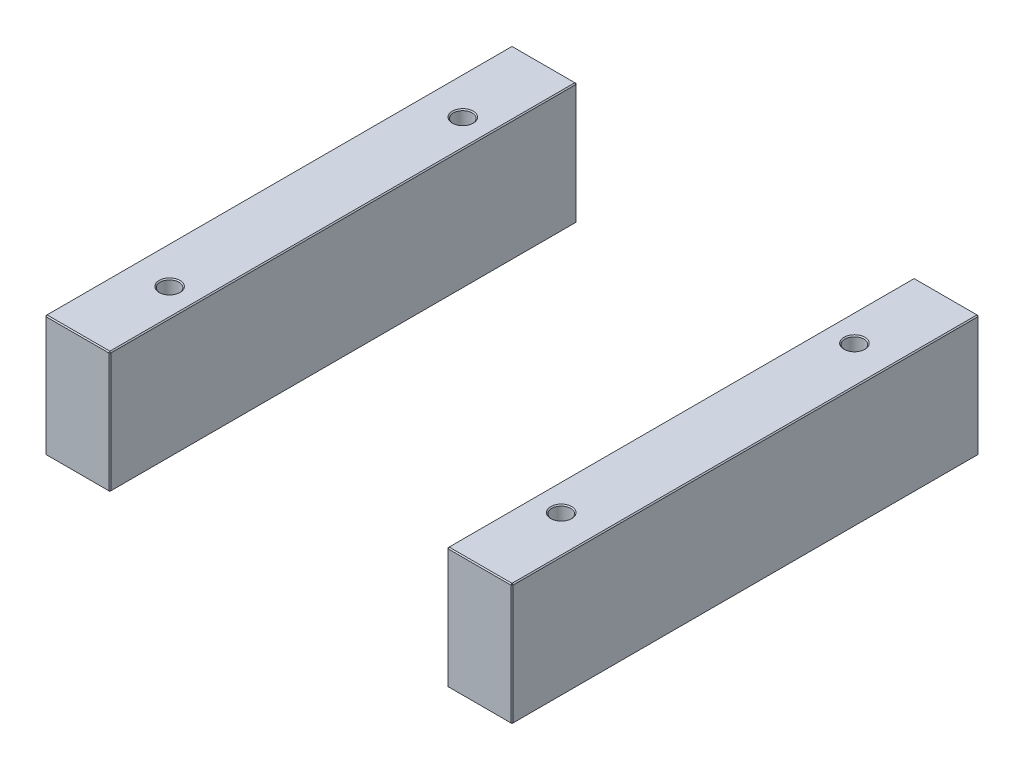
ISO-10303-21;
HEADER;
FILE_DESCRIPTION(('STEP AP214'),'2;1');
FILE_NAME('part.step','',(''),(''),'','','');
FILE_SCHEMA(('AUTOMOTIVE_DESIGN { 1 0 10303 214 1 1 1 1 }'));
ENDSEC;
DATA;
#1=APPLICATION_CONTEXT('core data for automotive mechanical design processes');
#2=APPLICATION_PROTOCOL_DEFINITION('international standard','automotive_design',2000,#1);
#3=PRODUCT_CONTEXT('',#1,'mechanical');
#4=PRODUCT('Part','Part','',(#3));
#5=PRODUCT_RELATED_PRODUCT_CATEGORY('part','',(#4));
#6=PRODUCT_DEFINITION_FORMATION('','',#4);
#7=PRODUCT_DEFINITION_CONTEXT('part definition',#1,'design');
#8=PRODUCT_DEFINITION('design','',#6,#7);
#9=PRODUCT_DEFINITION_SHAPE('','',#8);
#10=(LENGTH_UNIT() NAMED_UNIT(*) SI_UNIT(.MILLI.,.METRE.));
#11=(NAMED_UNIT(*) PLANE_ANGLE_UNIT() SI_UNIT($,.RADIAN.));
#12=(NAMED_UNIT(*) SI_UNIT($,.STERADIAN.) SOLID_ANGLE_UNIT());
#13=UNCERTAINTY_MEASURE_WITH_UNIT(LENGTH_MEASURE(1.E-05),#10,'distance_accuracy_value','');
#14=(GEOMETRIC_REPRESENTATION_CONTEXT(3) GLOBAL_UNCERTAINTY_ASSIGNED_CONTEXT((#13)) GLOBAL_UNIT_ASSIGNED_CONTEXT((#10,
#11,#12)) REPRESENTATION_CONTEXT('',''));
#15=CARTESIAN_POINT('',(0.,0.,0.));
#16=DIRECTION('',(0.,0.,1.));
#17=DIRECTION('',(1.,0.,0.));
#18=AXIS2_PLACEMENT_3D('',#15,#16,#17);
#19=CARTESIAN_POINT('',(-223.,116.,-223.));
#20=DIRECTION('',(0.,0.,1.));
#21=DIRECTION('',(1.,0.,0.));
#22=AXIS2_PLACEMENT_3D('',#19,#20,#21);
#23=PLANE('',#22);
#24=DIRECTION('',(-1.,0.,0.));
#25=VECTOR('',#24,1.);
#26=CARTESIAN_POINT('',(-223.,0.999999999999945,-223.));
#27=LINE('',#26,#25);
#28=CARTESIAN_POINT('',(-162.,0.999999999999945,-223.));
#29=VERTEX_POINT('',#28);
#30=CARTESIAN_POINT('',(-222.,0.999999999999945,-223.));
#31=VERTEX_POINT('',#30);
#32=EDGE_CURVE('P0_E137',#29,#31,#27,.T.);
#33=ORIENTED_EDGE('',*,*,#32,.T.);
#34=DIRECTION('',(0.,1.,0.));
#35=VECTOR('',#34,1.);
#36=CARTESIAN_POINT('',(-222.,116.,-223.));
#37=LINE('',#36,#35);
#38=CARTESIAN_POINT('',(-222.,115.,-223.));
#39=VERTEX_POINT('',#38);
#40=EDGE_CURVE('P0_E235',#31,#39,#37,.T.);
#41=ORIENTED_EDGE('',*,*,#40,.T.);
#42=DIRECTION('',(1.,0.,0.));
#43=VECTOR('',#42,1.);
#44=CARTESIAN_POINT('',(-223.,115.,-223.));
#45=LINE('',#44,#43);
#46=CARTESIAN_POINT('',(-162.,115.,-223.));
#47=VERTEX_POINT('',#46);
#48=EDGE_CURVE('P0_E233',#39,#47,#45,.T.);
#49=ORIENTED_EDGE('',*,*,#48,.T.);
#50=DIRECTION('',(0.,-1.,0.));
#51=VECTOR('',#50,1.);
#52=CARTESIAN_POINT('',(-162.,116.,-223.));
#53=LINE('',#52,#51);
#54=EDGE_CURVE('P0_E230',#47,#29,#53,.T.);
#55=ORIENTED_EDGE('',*,*,#54,.T.);
#56=EDGE_LOOP('',(#33,#41,#49,#55));
#57=FACE_BOUND('',#56,.T.);
#58=ADVANCED_FACE('P0_F16',(#57),#23,.F.);
#59=CARTESIAN_POINT('',(-223.,116.,223.));
#60=DIRECTION('',(1.,0.,0.));
#61=DIRECTION('',(0.,0.,-1.));
#62=AXIS2_PLACEMENT_3D('',#59,#60,#61);
#63=PLANE('',#62);
#64=DIRECTION('',(0.,1.,0.));
#65=VECTOR('',#64,1.);
#66=CARTESIAN_POINT('',(-223.,116.,222.));
#67=LINE('',#66,#65);
#68=CARTESIAN_POINT('',(-223.,0.999999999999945,222.));
#69=VERTEX_POINT('',#68);
#70=CARTESIAN_POINT('',(-223.,115.,222.));
#71=VERTEX_POINT('',#70);
#72=EDGE_CURVE('P0_E217',#69,#71,#67,.T.);
#73=ORIENTED_EDGE('',*,*,#72,.T.);
#74=DIRECTION('',(0.,0.,-1.));
#75=VECTOR('',#74,1.);
#76=CARTESIAN_POINT('',(-223.,115.,223.));
#77=LINE('',#76,#75);
#78=CARTESIAN_POINT('',(-223.,115.,-222.));
#79=VERTEX_POINT('',#78);
#80=EDGE_CURVE('P0_E228',#71,#79,#77,.T.);
#81=ORIENTED_EDGE('',*,*,#80,.T.);
#82=DIRECTION('',(0.,-1.,0.));
#83=VECTOR('',#82,1.);
#84=CARTESIAN_POINT('',(-223.,116.,-222.));
#85=LINE('',#84,#83);
#86=CARTESIAN_POINT('',(-223.,0.999999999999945,-222.));
#87=VERTEX_POINT('',#86);
#88=EDGE_CURVE('P0_E225',#79,#87,#85,.T.);
#89=ORIENTED_EDGE('',*,*,#88,.T.);
#90=DIRECTION('',(0.,0.,1.));
#91=VECTOR('',#90,1.);
#92=CARTESIAN_POINT('',(-223.,0.999999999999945,223.));
#93=LINE('',#92,#91);
#94=EDGE_CURVE('P0_E214',#87,#69,#93,.T.);
#95=ORIENTED_EDGE('',*,*,#94,.T.);
#96=EDGE_LOOP('',(#73,#81,#89,#95));
#97=FACE_BOUND('',#96,.T.);
#98=ADVANCED_FACE('P0_F302',(#97),#63,.F.);
#99=CARTESIAN_POINT('',(-223.,116.,223.));
#100=DIRECTION('',(0.,0.,-1.));
#101=DIRECTION('',(-1.,0.,0.));
#102=AXIS2_PLACEMENT_3D('',#99,#100,#101);
#103=PLANE('',#102);
#104=DIRECTION('',(-1.,0.,0.));
#105=VECTOR('',#104,1.);
#106=CARTESIAN_POINT('',(-223.,115.,223.));
#107=LINE('',#106,#105);
#108=CARTESIAN_POINT('',(-162.,115.,223.));
#109=VERTEX_POINT('',#108);
#110=CARTESIAN_POINT('',(-222.,115.,223.));
#111=VERTEX_POINT('',#110);
#112=EDGE_CURVE('P0_E242',#109,#111,#107,.T.);
#113=ORIENTED_EDGE('',*,*,#112,.T.);
#114=DIRECTION('',(0.,-1.,0.));
#115=VECTOR('',#114,1.);
#116=CARTESIAN_POINT('',(-222.,116.,223.));
#117=LINE('',#116,#115);
#118=CARTESIAN_POINT('',(-222.,0.999999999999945,223.));
#119=VERTEX_POINT('',#118);
#120=EDGE_CURVE('P0_E244',#111,#119,#117,.T.);
#121=ORIENTED_EDGE('',*,*,#120,.T.);
#122=DIRECTION('',(1.,0.,0.));
#123=VECTOR('',#122,1.);
#124=CARTESIAN_POINT('',(-161.,0.999999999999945,223.));
#125=LINE('',#124,#123);
#126=CARTESIAN_POINT('',(-162.,0.999999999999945,223.));
#127=VERTEX_POINT('',#126);
#128=EDGE_CURVE('P0_E240',#119,#127,#125,.T.);
#129=ORIENTED_EDGE('',*,*,#128,.T.);
#130=DIRECTION('',(0.,1.,0.));
#131=VECTOR('',#130,1.);
#132=CARTESIAN_POINT('',(-162.,116.,223.));
#133=LINE('',#132,#131);
#134=EDGE_CURVE('P0_E238',#127,#109,#133,.T.);
#135=ORIENTED_EDGE('',*,*,#134,.T.);
#136=EDGE_LOOP('',(#113,#121,#129,#135));
#137=FACE_BOUND('',#136,.T.);
#138=ADVANCED_FACE('P0_F341',(#137),#103,.F.);
#139=CARTESIAN_POINT('',(-161.,116.,-223.));
#140=DIRECTION('',(-1.,0.,0.));
#141=DIRECTION('',(0.,0.,1.));
#142=AXIS2_PLACEMENT_3D('',#139,#140,#141);
#143=PLANE('',#142);
#144=DIRECTION('',(0.,0.,1.));
#145=VECTOR('',#144,1.);
#146=CARTESIAN_POINT('',(-161.,115.,-223.));
#147=LINE('',#146,#145);
#148=CARTESIAN_POINT('',(-161.,115.,-222.));
#149=VERTEX_POINT('',#148);
#150=CARTESIAN_POINT('',(-161.,115.,222.));
#151=VERTEX_POINT('',#150);
#152=EDGE_CURVE('P0_E31',#149,#151,#147,.T.);
#153=ORIENTED_EDGE('',*,*,#152,.T.);
#154=DIRECTION('',(0.,-1.,0.));
#155=VECTOR('',#154,1.);
#156=CARTESIAN_POINT('',(-161.,116.,222.));
#157=LINE('',#156,#155);
#158=CARTESIAN_POINT('',(-161.,0.999999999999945,222.));
#159=VERTEX_POINT('',#158);
#160=EDGE_CURVE('P0_E190',#151,#159,#157,.T.);
#161=ORIENTED_EDGE('',*,*,#160,.T.);
#162=DIRECTION('',(0.,0.,-1.));
#163=VECTOR('',#162,1.);
#164=CARTESIAN_POINT('',(-161.,0.999999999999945,-223.));
#165=LINE('',#164,#163);
#166=CARTESIAN_POINT('',(-161.,0.999999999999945,-222.));
#167=VERTEX_POINT('',#166);
#168=EDGE_CURVE('P0_E256',#159,#167,#165,.T.);
#169=ORIENTED_EDGE('',*,*,#168,.T.);
#170=DIRECTION('',(0.,1.,0.));
#171=VECTOR('',#170,1.);
#172=CARTESIAN_POINT('',(-161.,116.,-222.));
#173=LINE('',#172,#171);
#174=EDGE_CURVE('P0_E36',#167,#149,#173,.T.);
#175=ORIENTED_EDGE('',*,*,#174,.T.);
#176=EDGE_LOOP('',(#153,#161,#169,#175));
#177=FACE_BOUND('',#176,.T.);
#178=ADVANCED_FACE('P0_F535',(#177),#143,.F.);
#179=CARTESIAN_POINT('',(0.,116.,0.));
#180=DIRECTION('',(0.,-1.,0.));
#181=DIRECTION('',(0.,0.,-1.));
#182=AXIS2_PLACEMENT_3D('',#179,#180,#181);
#183=PLANE('',#182);
#184=CARTESIAN_POINT('',(-187.,116.,140.));
#185=DIRECTION('',(0.,-1.,0.));
#186=DIRECTION('',(0.,0.,-1.));
#187=AXIS2_PLACEMENT_3D('',#184,#185,#186);
#188=CIRCLE('',#187,10.0000000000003);
#189=CARTESIAN_POINT('',(-187.,116.,130.));
#190=VERTEX_POINT('',#189);
#191=EDGE_CURVE('P0_E24',#190,#190,#188,.T.);
#192=ORIENTED_EDGE('',*,*,#191,.T.);
#193=EDGE_LOOP('',(#192));
#194=FACE_BOUND('',#193,.T.);
#195=CARTESIAN_POINT('',(-187.,116.,-140.));
#196=DIRECTION('',(0.,-1.,0.));
#197=DIRECTION('',(0.,0.,-1.));
#198=AXIS2_PLACEMENT_3D('',#195,#196,#197);
#199=CIRCLE('',#198,10.0000000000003);
#200=CARTESIAN_POINT('',(-187.,116.,-150.));
#201=VERTEX_POINT('',#200);
#202=EDGE_CURVE('P0_E189',#201,#201,#199,.T.);
#203=ORIENTED_EDGE('',*,*,#202,.T.);
#204=EDGE_LOOP('',(#203));
#205=FACE_BOUND('',#204,.T.);
#206=DIRECTION('',(0.,0.,1.));
#207=VECTOR('',#206,1.);
#208=CARTESIAN_POINT('',(-222.,116.,0.));
#209=LINE('',#208,#207);
#210=CARTESIAN_POINT('',(-222.,116.,-222.));
#211=VERTEX_POINT('',#210);
#212=CARTESIAN_POINT('',(-222.,116.,222.));
#213=VERTEX_POINT('',#212);
#214=EDGE_CURVE('P0_E251',#211,#213,#209,.T.);
#215=ORIENTED_EDGE('',*,*,#214,.T.);
#216=DIRECTION('',(1.,0.,0.));
#217=VECTOR('',#216,1.);
#218=CARTESIAN_POINT('',(0.,116.,222.));
#219=LINE('',#218,#217);
#220=CARTESIAN_POINT('',(-162.,116.,222.));
#221=VERTEX_POINT('',#220);
#222=EDGE_CURVE('P0_E253',#213,#221,#219,.T.);
#223=ORIENTED_EDGE('',*,*,#222,.T.);
#224=DIRECTION('',(0.,0.,-1.));
#225=VECTOR('',#224,1.);
#226=CARTESIAN_POINT('',(-162.,116.,0.));
#227=LINE('',#226,#225);
#228=CARTESIAN_POINT('',(-162.,116.,-222.));
#229=VERTEX_POINT('',#228);
#230=EDGE_CURVE('P0_E247',#221,#229,#227,.T.);
#231=ORIENTED_EDGE('',*,*,#230,.T.);
#232=DIRECTION('',(-1.,0.,0.));
#233=VECTOR('',#232,1.);
#234=CARTESIAN_POINT('',(0.,116.,-222.));
#235=LINE('',#234,#233);
#236=EDGE_CURVE('P0_E249',#229,#211,#235,.T.);
#237=ORIENTED_EDGE('',*,*,#236,.T.);
#238=EDGE_LOOP('',(#215,#223,#231,#237));
#239=FACE_BOUND('',#238,.T.);
#240=ADVANCED_FACE('P0_F195',(#194,#205,#239),#183,.F.);
#241=CARTESIAN_POINT('',(0.,0.,0.));
#242=DIRECTION('',(0.,-1.,0.));
#243=DIRECTION('',(0.,0.,-1.));
#244=AXIS2_PLACEMENT_3D('',#241,#242,#243);
#245=PLANE('',#244);
#246=CARTESIAN_POINT('',(-187.,0.,-140.));
#247=DIRECTION('',(0.,-1.,0.));
#248=DIRECTION('',(0.,0.,-1.));
#249=AXIS2_PLACEMENT_3D('',#246,#247,#248);
#250=CIRCLE('',#249,9.99999999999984);
#251=CARTESIAN_POINT('',(-187.,0.,-150.));
#252=VERTEX_POINT('',#251);
#253=EDGE_CURVE('P0_E220',#252,#252,#250,.F.);
#254=ORIENTED_EDGE('',*,*,#253,.T.);
#255=EDGE_LOOP('',(#254));
#256=FACE_BOUND('',#255,.T.);
#257=CARTESIAN_POINT('',(-187.,0.,140.));
#258=DIRECTION('',(0.,-1.,0.));
#259=DIRECTION('',(0.,0.,-1.));
#260=AXIS2_PLACEMENT_3D('',#257,#258,#259);
#261=CIRCLE('',#260,9.99999999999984);
#262=CARTESIAN_POINT('',(-187.,0.,130.));
#263=VERTEX_POINT('',#262);
#264=EDGE_CURVE('P0_E608',#263,#263,#261,.F.);
#265=ORIENTED_EDGE('',*,*,#264,.T.);
#266=EDGE_LOOP('',(#265));
#267=FACE_BOUND('',#266,.T.);
#268=DIRECTION('',(-1.,0.,0.));
#269=VECTOR('',#268,1.);
#270=CARTESIAN_POINT('',(-223.,0.,222.));
#271=LINE('',#270,#269);
#272=CARTESIAN_POINT('',(-162.,0.,222.));
#273=VERTEX_POINT('',#272);
#274=CARTESIAN_POINT('',(-222.,0.,222.));
#275=VERTEX_POINT('',#274);
#276=EDGE_CURVE('P0_E114',#273,#275,#271,.T.);
#277=ORIENTED_EDGE('',*,*,#276,.T.);
#278=DIRECTION('',(0.,0.,-1.));
#279=VECTOR('',#278,1.);
#280=CARTESIAN_POINT('',(-222.,0.,-223.));
#281=LINE('',#280,#279);
#282=CARTESIAN_POINT('',(-222.,0.,-222.));
#283=VERTEX_POINT('',#282);
#284=EDGE_CURVE('P0_E110',#275,#283,#281,.T.);
#285=ORIENTED_EDGE('',*,*,#284,.T.);
#286=DIRECTION('',(1.,0.,0.));
#287=VECTOR('',#286,1.);
#288=CARTESIAN_POINT('',(-161.,0.,-222.));
#289=LINE('',#288,#287);
#290=CARTESIAN_POINT('',(-162.,0.,-222.));
#291=VERTEX_POINT('',#290);
#292=EDGE_CURVE('P0_E104',#283,#291,#289,.T.);
#293=ORIENTED_EDGE('',*,*,#292,.T.);
#294=DIRECTION('',(0.,0.,1.));
#295=VECTOR('',#294,1.);
#296=CARTESIAN_POINT('',(-162.,0.,223.));
#297=LINE('',#296,#295);
#298=EDGE_CURVE('P0_E107',#291,#273,#297,.T.);
#299=ORIENTED_EDGE('',*,*,#298,.T.);
#300=EDGE_LOOP('',(#277,#285,#293,#299));
#301=FACE_BOUND('',#300,.T.);
#302=ADVANCED_FACE('P0_F106',(#256,#267,#301),#245,.T.);
#303=CARTESIAN_POINT('',(-187.,0.,-140.));
#304=DIRECTION('',(0.,1.,0.));
#305=DIRECTION('',(0.,0.,1.));
#306=AXIS2_PLACEMENT_3D('',#303,#304,#305);
#307=CYLINDRICAL_SURFACE('',#306,9.);
#308=CARTESIAN_POINT('',(-187.,115.,-140.));
#309=DIRECTION('',(0.,-1.,0.));
#310=DIRECTION('',(0.,0.,-1.));
#311=AXIS2_PLACEMENT_3D('',#308,#309,#310);
#312=CIRCLE('',#311,9.);
#313=CARTESIAN_POINT('',(-187.,115.,-149.));
#314=VERTEX_POINT('',#313);
#315=EDGE_CURVE('P0_E10',#314,#314,#312,.F.);
#316=ORIENTED_EDGE('',*,*,#315,.T.);
#317=EDGE_LOOP('',(#316));
#318=FACE_BOUND('',#317,.T.);
#319=CARTESIAN_POINT('',(-187.,0.99999999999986,-140.));
#320=DIRECTION('',(0.,-1.,0.));
#321=DIRECTION('',(0.,0.,-1.));
#322=AXIS2_PLACEMENT_3D('',#319,#320,#321);
#323=CIRCLE('',#322,9.);
#324=CARTESIAN_POINT('',(-187.,0.99999999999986,-149.));
#325=VERTEX_POINT('',#324);
#326=EDGE_CURVE('P0_E215',#325,#325,#323,.T.);
#327=ORIENTED_EDGE('',*,*,#326,.T.);
#328=EDGE_LOOP('',(#327));
#329=FACE_BOUND('',#328,.T.);
#330=ADVANCED_FACE('P0_F208',(#318,#329),#307,.F.);
#331=CARTESIAN_POINT('',(-187.,0.,140.));
#332=DIRECTION('',(0.,1.,0.));
#333=DIRECTION('',(0.,0.,1.));
#334=AXIS2_PLACEMENT_3D('',#331,#332,#333);
#335=CYLINDRICAL_SURFACE('',#334,9.);
#336=CARTESIAN_POINT('',(-187.,115.,140.));
#337=DIRECTION('',(0.,-1.,0.));
#338=DIRECTION('',(0.,0.,-1.));
#339=AXIS2_PLACEMENT_3D('',#336,#337,#338);
#340=CIRCLE('',#339,9.);
#341=CARTESIAN_POINT('',(-187.,115.,131.));
#342=VERTEX_POINT('',#341);
#343=EDGE_CURVE('P0_E186',#342,#342,#340,.F.);
#344=ORIENTED_EDGE('',*,*,#343,.T.);
#345=EDGE_LOOP('',(#344));
#346=FACE_BOUND('',#345,.T.);
#347=CARTESIAN_POINT('',(-187.,0.99999999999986,140.));
#348=DIRECTION('',(0.,-1.,0.));
#349=DIRECTION('',(0.,0.,-1.));
#350=AXIS2_PLACEMENT_3D('',#347,#348,#349);
#351=CIRCLE('',#350,9.);
#352=CARTESIAN_POINT('',(-187.,0.99999999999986,131.));
#353=VERTEX_POINT('',#352);
#354=EDGE_CURVE('P0_E212',#353,#353,#351,.T.);
#355=ORIENTED_EDGE('',*,*,#354,.T.);
#356=EDGE_LOOP('',(#355));
#357=FACE_BOUND('',#356,.T.);
#358=ADVANCED_FACE('P0_F204',(#346,#357),#335,.F.);
#359=CARTESIAN_POINT('',(-187.,0.,-140.));
#360=DIRECTION('',(0.,-1.,0.));
#361=DIRECTION('',(0.,0.,-1.));
#362=AXIS2_PLACEMENT_3D('',#359,#360,#361);
#363=CONICAL_SURFACE('',#362,9.99999999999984,0.785398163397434);
#364=ORIENTED_EDGE('',*,*,#326,.F.);
#365=EDGE_LOOP('',(#364));
#366=FACE_BOUND('',#365,.T.);
#367=ORIENTED_EDGE('',*,*,#253,.F.);
#368=EDGE_LOOP('',(#367));
#369=FACE_BOUND('',#368,.T.);
#370=ADVANCED_FACE('P0_F207',(#366,#369),#363,.F.);
#371=CARTESIAN_POINT('',(-187.,0.,140.));
#372=DIRECTION('',(0.,-1.,0.));
#373=DIRECTION('',(0.,0.,-1.));
#374=AXIS2_PLACEMENT_3D('',#371,#372,#373);
#375=CONICAL_SURFACE('',#374,9.99999999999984,0.785398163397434);
#376=ORIENTED_EDGE('',*,*,#354,.F.);
#377=EDGE_LOOP('',(#376));
#378=FACE_BOUND('',#377,.T.);
#379=ORIENTED_EDGE('',*,*,#264,.F.);
#380=EDGE_LOOP('',(#379));
#381=FACE_BOUND('',#380,.T.);
#382=ADVANCED_FACE('P0_F347',(#378,#381),#375,.F.);
#383=CARTESIAN_POINT('',(-161.,116.,222.));
#384=DIRECTION('',(-0.707106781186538,0.,-0.707106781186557));
#385=DIRECTION('',(0.,-1.,0.));
#386=AXIS2_PLACEMENT_3D('',#383,#384,#385);
#387=PLANE('',#386);
#388=DIRECTION('',(-0.707106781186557,0.,0.707106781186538));
#389=VECTOR('',#388,1.);
#390=CARTESIAN_POINT('',(-161.5,115.,222.5));
#391=LINE('',#390,#389);
#392=EDGE_CURVE('P0_E125',#109,#151,#391,.F.);
#393=ORIENTED_EDGE('',*,*,#392,.F.);
#394=ORIENTED_EDGE('',*,*,#134,.F.);
#395=DIRECTION('',(0.707106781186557,0.,-0.707106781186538));
#396=VECTOR('',#395,1.);
#397=CARTESIAN_POINT('',(-162.,0.999999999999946,223.));
#398=LINE('',#397,#396);
#399=EDGE_CURVE('P0_E181',#159,#127,#398,.F.);
#400=ORIENTED_EDGE('',*,*,#399,.F.);
#401=ORIENTED_EDGE('',*,*,#160,.F.);
#402=EDGE_LOOP('',(#393,#394,#400,#401));
#403=FACE_BOUND('',#402,.T.);
#404=ADVANCED_FACE('P0_F351',(#403),#387,.F.);
#405=CARTESIAN_POINT('',(-162.,116.,222.));
#406=DIRECTION('',(0.577350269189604,0.57735026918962,0.577350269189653));
#407=DIRECTION('',(0.,-0.707106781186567,0.707106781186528));
#408=AXIS2_PLACEMENT_3D('',#405,#406,#407);
#409=PLANE('',#408);
#410=DIRECTION('',(0.,0.707106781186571,-0.707106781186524));
#411=VECTOR('',#410,1.);
#412=CARTESIAN_POINT('',(-162.,116.,222.));
#413=LINE('',#412,#411);
#414=EDGE_CURVE('P0_E175',#109,#221,#413,.T.);
#415=ORIENTED_EDGE('',*,*,#414,.F.);
#416=ORIENTED_EDGE('',*,*,#392,.T.);
#417=DIRECTION('',(0.707106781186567,-0.707106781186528,0.));
#418=VECTOR('',#417,1.);
#419=CARTESIAN_POINT('',(-162.,116.,222.));
#420=LINE('',#419,#418);
#421=EDGE_CURVE('P0_E178',#221,#151,#420,.T.);
#422=ORIENTED_EDGE('',*,*,#421,.F.);
#423=EDGE_LOOP('',(#415,#416,#422));
#424=FACE_BOUND('',#423,.T.);
#425=ADVANCED_FACE('P0_F487',(#424),#409,.T.);
#426=CARTESIAN_POINT('',(-162.,0.999999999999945,223.));
#427=DIRECTION('',(0.577350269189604,-0.577350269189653,0.57735026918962));
#428=DIRECTION('',(0.,-0.707106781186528,-0.707106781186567));
#429=AXIS2_PLACEMENT_3D('',#426,#427,#428);
#430=PLANE('',#429);
#431=DIRECTION('',(0.707106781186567,0.707106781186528,0.));
#432=VECTOR('',#431,1.);
#433=CARTESIAN_POINT('',(-161.5,0.499999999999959,222.));
#434=LINE('',#433,#432);
#435=EDGE_CURVE('P0_E123',#159,#273,#434,.F.);
#436=ORIENTED_EDGE('',*,*,#435,.F.);
#437=ORIENTED_EDGE('',*,*,#399,.T.);
#438=DIRECTION('',(0.,-0.707106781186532,-0.707106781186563));
#439=VECTOR('',#438,1.);
#440=CARTESIAN_POINT('',(-162.,0.999999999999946,223.));
#441=LINE('',#440,#439);
#442=EDGE_CURVE('P0_E172',#273,#127,#441,.F.);
#443=ORIENTED_EDGE('',*,*,#442,.F.);
#444=EDGE_LOOP('',(#436,#437,#443));
#445=FACE_BOUND('',#444,.T.);
#446=ADVANCED_FACE('P0_F478',(#445),#430,.T.);
#447=CARTESIAN_POINT('',(-162.,116.,0.));
#448=DIRECTION('',(-0.707106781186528,-0.707106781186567,0.));
#449=DIRECTION('',(0.,0.,-1.));
#450=AXIS2_PLACEMENT_3D('',#447,#448,#449);
#451=PLANE('',#450);
#452=ORIENTED_EDGE('',*,*,#421,.T.);
#453=ORIENTED_EDGE('',*,*,#152,.F.);
#454=DIRECTION('',(-0.707106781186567,0.707106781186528,0.));
#455=VECTOR('',#454,1.);
#456=CARTESIAN_POINT('',(-161.5,115.5,-222.));
#457=LINE('',#456,#455);
#458=EDGE_CURVE('P0_E165',#229,#149,#457,.F.);
#459=ORIENTED_EDGE('',*,*,#458,.F.);
#460=ORIENTED_EDGE('',*,*,#230,.F.);
#461=EDGE_LOOP('',(#452,#453,#459,#460));
#462=FACE_BOUND('',#461,.T.);
#463=ADVANCED_FACE('P0_F318',(#462),#451,.F.);
#464=CARTESIAN_POINT('',(0.,116.,222.));
#465=DIRECTION('',(0.,-0.707106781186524,-0.707106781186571));
#466=DIRECTION('',(1.,0.,0.));
#467=AXIS2_PLACEMENT_3D('',#464,#465,#466);
#468=PLANE('',#467);
#469=ORIENTED_EDGE('',*,*,#414,.T.);
#470=ORIENTED_EDGE('',*,*,#222,.F.);
#471=DIRECTION('',(0.,-0.707106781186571,0.707106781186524));
#472=VECTOR('',#471,1.);
#473=CARTESIAN_POINT('',(-222.,115.5,222.5));
#474=LINE('',#473,#472);
#475=EDGE_CURVE('P0_E162',#111,#213,#474,.F.);
#476=ORIENTED_EDGE('',*,*,#475,.F.);
#477=ORIENTED_EDGE('',*,*,#112,.F.);
#478=EDGE_LOOP('',(#469,#470,#476,#477));
#479=FACE_BOUND('',#478,.T.);
#480=ADVANCED_FACE('P0_F313',(#479),#468,.F.);
#481=CARTESIAN_POINT('',(-222.,116.,223.));
#482=DIRECTION('',(0.707106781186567,0.,-0.707106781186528));
#483=DIRECTION('',(0.,-1.,0.));
#484=AXIS2_PLACEMENT_3D('',#481,#482,#483);
#485=PLANE('',#484);
#486=DIRECTION('',(0.707106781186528,0.,0.707106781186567));
#487=VECTOR('',#486,1.);
#488=CARTESIAN_POINT('',(-222.,0.999999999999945,223.));
#489=LINE('',#488,#487);
#490=EDGE_CURVE('P0_E156',#119,#69,#489,.F.);
#491=ORIENTED_EDGE('',*,*,#490,.F.);
#492=ORIENTED_EDGE('',*,*,#120,.F.);
#493=DIRECTION('',(-0.707106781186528,0.,-0.707106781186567));
#494=VECTOR('',#493,1.);
#495=CARTESIAN_POINT('',(-223.,115.,222.));
#496=LINE('',#495,#494);
#497=EDGE_CURVE('P0_E159',#71,#111,#496,.F.);
#498=ORIENTED_EDGE('',*,*,#497,.F.);
#499=ORIENTED_EDGE('',*,*,#72,.F.);
#500=EDGE_LOOP('',(#491,#492,#498,#499));
#501=FACE_BOUND('',#500,.T.);
#502=ADVANCED_FACE('P0_F307',(#501),#485,.F.);
#503=CARTESIAN_POINT('',(-223.,0.999999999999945,223.));
#504=DIRECTION('',(0.,-0.707106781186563,0.707106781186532));
#505=DIRECTION('',(-1.,0.,0.));
#506=AXIS2_PLACEMENT_3D('',#503,#504,#505);
#507=PLANE('',#506);
#508=ORIENTED_EDGE('',*,*,#442,.T.);
#509=ORIENTED_EDGE('',*,*,#128,.F.);
#510=DIRECTION('',(0.,0.707106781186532,0.707106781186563));
#511=VECTOR('',#510,1.);
#512=CARTESIAN_POINT('',(-222.,0.999999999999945,223.));
#513=LINE('',#512,#511);
#514=EDGE_CURVE('P0_E134',#275,#119,#513,.T.);
#515=ORIENTED_EDGE('',*,*,#514,.F.);
#516=ORIENTED_EDGE('',*,*,#276,.F.);
#517=EDGE_LOOP('',(#508,#509,#515,#516));
#518=FACE_BOUND('',#517,.T.);
#519=ADVANCED_FACE('P0_F333',(#518),#507,.T.);
#520=CARTESIAN_POINT('',(-161.,0.999999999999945,-223.));
#521=DIRECTION('',(0.707106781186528,-0.707106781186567,0.));
#522=DIRECTION('',(0.,0.,1.));
#523=AXIS2_PLACEMENT_3D('',#520,#521,#522);
#524=PLANE('',#523);
#525=ORIENTED_EDGE('',*,*,#435,.T.);
#526=ORIENTED_EDGE('',*,*,#298,.F.);
#527=DIRECTION('',(-0.707106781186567,-0.707106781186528,0.));
#528=VECTOR('',#527,1.);
#529=CARTESIAN_POINT('',(-162.,0.,-222.));
#530=LINE('',#529,#528);
#531=EDGE_CURVE('P0_E120',#167,#291,#530,.T.);
#532=ORIENTED_EDGE('',*,*,#531,.F.);
#533=ORIENTED_EDGE('',*,*,#168,.F.);
#534=EDGE_LOOP('',(#525,#526,#532,#533));
#535=FACE_BOUND('',#534,.T.);
#536=ADVANCED_FACE('P0_F119',(#535),#524,.T.);
#537=CARTESIAN_POINT('',(-162.,116.,-223.));
#538=DIRECTION('',(-0.707106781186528,0.,0.707106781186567));
#539=DIRECTION('',(0.,-1.,0.));
#540=AXIS2_PLACEMENT_3D('',#537,#538,#539);
#541=PLANE('',#540);
#542=DIRECTION('',(0.707106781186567,0.,0.707106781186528));
#543=VECTOR('',#542,1.);
#544=CARTESIAN_POINT('',(-162.,115.,-223.));
#545=LINE('',#544,#543);
#546=EDGE_CURVE('P0_E168',#149,#47,#545,.F.);
#547=ORIENTED_EDGE('',*,*,#546,.F.);
#548=ORIENTED_EDGE('',*,*,#174,.F.);
#549=DIRECTION('',(-0.707106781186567,0.,-0.707106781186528));
#550=VECTOR('',#549,1.);
#551=CARTESIAN_POINT('',(-161.5,0.999999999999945,-222.5));
#552=LINE('',#551,#550);
#553=EDGE_CURVE('P0_E133',#29,#167,#552,.F.);
#554=ORIENTED_EDGE('',*,*,#553,.F.);
#555=ORIENTED_EDGE('',*,*,#54,.F.);
#556=EDGE_LOOP('',(#547,#548,#554,#555));
#557=FACE_BOUND('',#556,.T.);
#558=ADVANCED_FACE('P0_F323',(#557),#541,.F.);
#559=CARTESIAN_POINT('',(-162.,115.,-223.));
#560=DIRECTION('',(0.577350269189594,0.577350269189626,-0.577350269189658));
#561=DIRECTION('',(0.,0.707106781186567,0.707106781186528));
#562=AXIS2_PLACEMENT_3D('',#559,#560,#561);
#563=PLANE('',#562);
#564=ORIENTED_EDGE('',*,*,#458,.T.);
#565=ORIENTED_EDGE('',*,*,#546,.T.);
#566=DIRECTION('',(0.,-0.707106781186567,-0.707106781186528));
#567=VECTOR('',#566,1.);
#568=CARTESIAN_POINT('',(-162.,115.,-223.));
#569=LINE('',#568,#567);
#570=EDGE_CURVE('P0_E151',#229,#47,#569,.T.);
#571=ORIENTED_EDGE('',*,*,#570,.F.);
#572=EDGE_LOOP('',(#564,#565,#571));
#573=FACE_BOUND('',#572,.T.);
#574=ADVANCED_FACE('P0_F321',(#573),#563,.T.);
#575=CARTESIAN_POINT('',(-223.,115.,222.));
#576=DIRECTION('',(-0.577350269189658,0.577350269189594,0.577350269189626));
#577=DIRECTION('',(0.707106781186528,0.,0.707106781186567));
#578=AXIS2_PLACEMENT_3D('',#575,#576,#577);
#579=PLANE('',#578);
#580=ORIENTED_EDGE('',*,*,#497,.T.);
#581=ORIENTED_EDGE('',*,*,#475,.T.);
#582=DIRECTION('',(0.707106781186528,0.707106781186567,0.));
#583=VECTOR('',#582,1.);
#584=CARTESIAN_POINT('',(-223.,115.,222.));
#585=LINE('',#584,#583);
#586=EDGE_CURVE('P0_E142',#71,#213,#585,.T.);
#587=ORIENTED_EDGE('',*,*,#586,.F.);
#588=EDGE_LOOP('',(#580,#581,#587));
#589=FACE_BOUND('',#588,.T.);
#590=ADVANCED_FACE('P0_F310',(#589),#579,.T.);
#591=CARTESIAN_POINT('',(-222.,0.999999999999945,223.));
#592=DIRECTION('',(-0.577350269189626,-0.577350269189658,0.577350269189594));
#593=DIRECTION('',(0.707106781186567,-0.707106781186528,0.));
#594=AXIS2_PLACEMENT_3D('',#591,#592,#593);
#595=PLANE('',#594);
#596=ORIENTED_EDGE('',*,*,#514,.T.);
#597=ORIENTED_EDGE('',*,*,#490,.T.);
#598=DIRECTION('',(0.707106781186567,-0.707106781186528,0.));
#599=VECTOR('',#598,1.);
#600=CARTESIAN_POINT('',(-222.5,0.499999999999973,222.));
#601=LINE('',#600,#599);
#602=EDGE_CURVE('P0_E138',#275,#69,#601,.F.);
#603=ORIENTED_EDGE('',*,*,#602,.F.);
#604=EDGE_LOOP('',(#596,#597,#603));
#605=FACE_BOUND('',#604,.T.);
#606=ADVANCED_FACE('P0_F368',(#605),#595,.T.);
#607=CARTESIAN_POINT('',(-162.,0.,-222.));
#608=DIRECTION('',(0.577350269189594,-0.577350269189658,-0.577350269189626));
#609=DIRECTION('',(0.,0.707106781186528,-0.707106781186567));
#610=AXIS2_PLACEMENT_3D('',#607,#608,#609);
#611=PLANE('',#610);
#612=ORIENTED_EDGE('',*,*,#553,.T.);
#613=ORIENTED_EDGE('',*,*,#531,.T.);
#614=DIRECTION('',(0.,0.707106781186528,-0.707106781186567));
#615=VECTOR('',#614,1.);
#616=CARTESIAN_POINT('',(-162.,0.,-222.));
#617=LINE('',#616,#615);
#618=EDGE_CURVE('P0_E130',#29,#291,#617,.F.);
#619=ORIENTED_EDGE('',*,*,#618,.F.);
#620=EDGE_LOOP('',(#612,#613,#619));
#621=FACE_BOUND('',#620,.T.);
#622=ADVANCED_FACE('P0_F129',(#621),#611,.T.);
#623=CARTESIAN_POINT('',(0.,116.,-222.));
#624=DIRECTION('',(0.,-0.707106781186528,0.707106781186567));
#625=DIRECTION('',(-1.,0.,0.));
#626=AXIS2_PLACEMENT_3D('',#623,#624,#625);
#627=PLANE('',#626);
#628=ORIENTED_EDGE('',*,*,#570,.T.);
#629=ORIENTED_EDGE('',*,*,#48,.F.);
#630=DIRECTION('',(0.,0.707106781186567,0.707106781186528));
#631=VECTOR('',#630,1.);
#632=CARTESIAN_POINT('',(-222.,115.,-223.));
#633=LINE('',#632,#631);
#634=EDGE_CURVE('P0_E139',#211,#39,#633,.F.);
#635=ORIENTED_EDGE('',*,*,#634,.F.);
#636=ORIENTED_EDGE('',*,*,#236,.F.);
#637=EDGE_LOOP('',(#628,#629,#635,#636));
#638=FACE_BOUND('',#637,.T.);
#639=ADVANCED_FACE('P0_F286',(#638),#627,.F.);
#640=CARTESIAN_POINT('',(-222.,116.,0.));
#641=DIRECTION('',(0.707106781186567,-0.707106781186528,0.));
#642=DIRECTION('',(0.,0.,1.));
#643=AXIS2_PLACEMENT_3D('',#640,#641,#642);
#644=PLANE('',#643);
#645=ORIENTED_EDGE('',*,*,#586,.T.);
#646=ORIENTED_EDGE('',*,*,#214,.F.);
#647=DIRECTION('',(-0.707106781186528,-0.707106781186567,0.));
#648=VECTOR('',#647,1.);
#649=CARTESIAN_POINT('',(-222.5,115.5,-222.));
#650=LINE('',#649,#648);
#651=EDGE_CURVE('P0_E145',#79,#211,#650,.F.);
#652=ORIENTED_EDGE('',*,*,#651,.F.);
#653=ORIENTED_EDGE('',*,*,#80,.F.);
#654=EDGE_LOOP('',(#645,#646,#652,#653));
#655=FACE_BOUND('',#654,.T.);
#656=ADVANCED_FACE('P0_F280',(#655),#644,.F.);
#657=CARTESIAN_POINT('',(-223.,0.999999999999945,223.));
#658=DIRECTION('',(-0.707106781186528,-0.707106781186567,0.));
#659=DIRECTION('',(0.,0.,-1.));
#660=AXIS2_PLACEMENT_3D('',#657,#658,#659);
#661=PLANE('',#660);
#662=ORIENTED_EDGE('',*,*,#602,.T.);
#663=ORIENTED_EDGE('',*,*,#94,.F.);
#664=DIRECTION('',(-0.707106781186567,0.707106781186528,0.));
#665=VECTOR('',#664,1.);
#666=CARTESIAN_POINT('',(-223.,0.999999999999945,-222.));
#667=LINE('',#666,#665);
#668=EDGE_CURVE('P0_E267',#283,#87,#667,.T.);
#669=ORIENTED_EDGE('',*,*,#668,.F.);
#670=ORIENTED_EDGE('',*,*,#284,.F.);
#671=EDGE_LOOP('',(#662,#663,#669,#670));
#672=FACE_BOUND('',#671,.T.);
#673=ADVANCED_FACE('P0_F298',(#672),#661,.T.);
#674=CARTESIAN_POINT('',(-223.,0.999999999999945,-223.));
#675=DIRECTION('',(0.,-0.707106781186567,-0.707106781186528));
#676=DIRECTION('',(1.,0.,0.));
#677=AXIS2_PLACEMENT_3D('',#674,#675,#676);
#678=PLANE('',#677);
#679=ORIENTED_EDGE('',*,*,#618,.T.);
#680=ORIENTED_EDGE('',*,*,#292,.F.);
#681=DIRECTION('',(0.,-0.707106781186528,0.707106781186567));
#682=VECTOR('',#681,1.);
#683=CARTESIAN_POINT('',(-222.,0.499999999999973,-222.5));
#684=LINE('',#683,#682);
#685=EDGE_CURVE('P0_E265',#31,#283,#684,.T.);
#686=ORIENTED_EDGE('',*,*,#685,.F.);
#687=ORIENTED_EDGE('',*,*,#32,.F.);
#688=EDGE_LOOP('',(#679,#680,#686,#687));
#689=FACE_BOUND('',#688,.T.);
#690=ADVANCED_FACE('P0_F136',(#689),#678,.T.);
#691=CARTESIAN_POINT('',(-222.,115.,-223.));
#692=DIRECTION('',(-0.577350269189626,0.577350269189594,-0.577350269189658));
#693=DIRECTION('',(-0.707106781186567,0.,0.707106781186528));
#694=AXIS2_PLACEMENT_3D('',#691,#692,#693);
#695=PLANE('',#694);
#696=ORIENTED_EDGE('',*,*,#651,.T.);
#697=ORIENTED_EDGE('',*,*,#634,.T.);
#698=DIRECTION('',(0.707106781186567,0.,-0.707106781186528));
#699=VECTOR('',#698,1.);
#700=CARTESIAN_POINT('',(-222.,115.,-223.));
#701=LINE('',#700,#699);
#702=EDGE_CURVE('P0_E263',#79,#39,#701,.T.);
#703=ORIENTED_EDGE('',*,*,#702,.F.);
#704=EDGE_LOOP('',(#696,#697,#703));
#705=FACE_BOUND('',#704,.T.);
#706=ADVANCED_FACE('P0_F273',(#705),#695,.T.);
#707=CARTESIAN_POINT('',(-223.,0.999999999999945,-222.));
#708=DIRECTION('',(-0.577350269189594,-0.577350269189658,-0.577350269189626));
#709=DIRECTION('',(0.,0.707106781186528,-0.707106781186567));
#710=AXIS2_PLACEMENT_3D('',#707,#708,#709);
#711=PLANE('',#710);
#712=ORIENTED_EDGE('',*,*,#685,.T.);
#713=ORIENTED_EDGE('',*,*,#668,.T.);
#714=DIRECTION('',(-0.707106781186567,0.,0.707106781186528));
#715=VECTOR('',#714,1.);
#716=CARTESIAN_POINT('',(-223.,0.999999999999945,-222.));
#717=LINE('',#716,#715);
#718=EDGE_CURVE('P0_E261',#31,#87,#717,.T.);
#719=ORIENTED_EDGE('',*,*,#718,.F.);
#720=EDGE_LOOP('',(#712,#713,#719));
#721=FACE_BOUND('',#720,.T.);
#722=ADVANCED_FACE('P0_F294',(#721),#711,.T.);
#723=CARTESIAN_POINT('',(-223.,116.,-222.));
#724=DIRECTION('',(0.707106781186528,0.,0.707106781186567));
#725=DIRECTION('',(0.,-1.,0.));
#726=AXIS2_PLACEMENT_3D('',#723,#724,#725);
#727=PLANE('',#726);
#728=ORIENTED_EDGE('',*,*,#702,.T.);
#729=ORIENTED_EDGE('',*,*,#40,.F.);
#730=ORIENTED_EDGE('',*,*,#718,.T.);
#731=ORIENTED_EDGE('',*,*,#88,.F.);
#732=EDGE_LOOP('',(#728,#729,#730,#731));
#733=FACE_BOUND('',#732,.T.);
#734=ADVANCED_FACE('P0_F201',(#733),#727,.F.);
#735=CARTESIAN_POINT('',(-187.,115.,140.));
#736=DIRECTION('',(0.,1.,0.));
#737=DIRECTION('',(0.,0.,1.));
#738=AXIS2_PLACEMENT_3D('',#735,#736,#737);
#739=CONICAL_SURFACE('',#738,9.,0.785398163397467);
#740=ORIENTED_EDGE('',*,*,#191,.F.);
#741=EDGE_LOOP('',(#740));
#742=FACE_BOUND('',#741,.T.);
#743=ORIENTED_EDGE('',*,*,#343,.F.);
#744=EDGE_LOOP('',(#743));
#745=FACE_BOUND('',#744,.T.);
#746=ADVANCED_FACE('P0_F198',(#742,#745),#739,.F.);
#747=CARTESIAN_POINT('',(-187.,115.,-140.));
#748=DIRECTION('',(0.,1.,0.));
#749=DIRECTION('',(0.,0.,1.));
#750=AXIS2_PLACEMENT_3D('',#747,#748,#749);
#751=CONICAL_SURFACE('',#750,9.,0.785398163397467);
#752=ORIENTED_EDGE('',*,*,#202,.F.);
#753=EDGE_LOOP('',(#752));
#754=FACE_BOUND('',#753,.T.);
#755=ORIENTED_EDGE('',*,*,#315,.F.);
#756=EDGE_LOOP('',(#755));
#757=FACE_BOUND('',#756,.T.);
#758=ADVANCED_FACE('P0_F18',(#754,#757),#751,.F.);
#759=CLOSED_SHELL('',(#58,#98,#138,#178,#240,#302,#330,#358,#370,#382,#404,#425,#446,#463,#480,
#502,#519,#536,#558,#574,#590,#606,#622,#639,#656,#673,#690,#706,#722,#734,#746,#758));
#760=MANIFOLD_SOLID_BREP('P0_B1',#759);
#761=CARTESIAN_POINT('',(223.,116.,223.));
#762=DIRECTION('',(0.,0.,-1.));
#763=DIRECTION('',(-1.,0.,0.));
#764=AXIS2_PLACEMENT_3D('',#761,#762,#763);
#765=PLANE('',#764);
#766=DIRECTION('',(0.,-1.,0.));
#767=VECTOR('',#766,1.);
#768=CARTESIAN_POINT('',(162.,116.,223.));
#769=LINE('',#768,#767);
#770=CARTESIAN_POINT('',(162.,115.,223.));
#771=VERTEX_POINT('',#770);
#772=CARTESIAN_POINT('',(162.,0.99999999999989,223.));
#773=VERTEX_POINT('',#772);
#774=EDGE_CURVE('P1_E174',#771,#773,#769,.T.);
#775=ORIENTED_EDGE('',*,*,#774,.T.);
#776=DIRECTION('',(1.,0.,0.));
#777=VECTOR('',#776,1.);
#778=CARTESIAN_POINT('',(223.,0.99999999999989,223.));
#779=LINE('',#778,#777);
#780=CARTESIAN_POINT('',(222.,0.99999999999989,223.));
#781=VERTEX_POINT('',#780);
#782=EDGE_CURVE('P1_E176',#773,#781,#779,.T.);
#783=ORIENTED_EDGE('',*,*,#782,.T.);
#784=DIRECTION('',(0.,1.,0.));
#785=VECTOR('',#784,1.);
#786=CARTESIAN_POINT('',(222.,116.,223.));
#787=LINE('',#786,#785);
#788=CARTESIAN_POINT('',(222.,115.,223.));
#789=VERTEX_POINT('',#788);
#790=EDGE_CURVE('P1_E172',#781,#789,#787,.T.);
#791=ORIENTED_EDGE('',*,*,#790,.T.);
#792=DIRECTION('',(-1.,0.,0.));
#793=VECTOR('',#792,1.);
#794=CARTESIAN_POINT('',(161.,115.,223.));
#795=LINE('',#794,#793);
#796=EDGE_CURVE('P1_E170',#789,#771,#795,.T.);
#797=ORIENTED_EDGE('',*,*,#796,.T.);
#798=EDGE_LOOP('',(#775,#783,#791,#797));
#799=FACE_BOUND('',#798,.T.);
#800=ADVANCED_FACE('P1_F17',(#799),#765,.F.);
#801=CARTESIAN_POINT('',(223.,116.,223.));
#802=DIRECTION('',(-1.,0.,0.));
#803=DIRECTION('',(0.,0.,1.));
#804=AXIS2_PLACEMENT_3D('',#801,#802,#803);
#805=PLANE('',#804);
#806=DIRECTION('',(0.,0.,1.));
#807=VECTOR('',#806,1.);
#808=CARTESIAN_POINT('',(223.,115.,223.));
#809=LINE('',#808,#807);
#810=CARTESIAN_POINT('',(223.,115.,-222.));
#811=VERTEX_POINT('',#810);
#812=CARTESIAN_POINT('',(223.,115.,222.));
#813=VERTEX_POINT('',#812);
#814=EDGE_CURVE('P1_E188',#811,#813,#809,.T.);
#815=ORIENTED_EDGE('',*,*,#814,.T.);
#816=DIRECTION('',(0.,-1.,0.));
#817=VECTOR('',#816,1.);
#818=CARTESIAN_POINT('',(223.,116.,222.));
#819=LINE('',#818,#817);
#820=CARTESIAN_POINT('',(223.,0.999999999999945,222.));
#821=VERTEX_POINT('',#820);
#822=EDGE_CURVE('P1_E194',#813,#821,#819,.T.);
#823=ORIENTED_EDGE('',*,*,#822,.T.);
#824=DIRECTION('',(0.,0.,-1.));
#825=VECTOR('',#824,1.);
#826=CARTESIAN_POINT('',(223.,0.999999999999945,223.));
#827=LINE('',#826,#825);
#828=CARTESIAN_POINT('',(223.,0.999999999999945,-222.));
#829=VERTEX_POINT('',#828);
#830=EDGE_CURVE('P1_E192',#821,#829,#827,.T.);
#831=ORIENTED_EDGE('',*,*,#830,.T.);
#832=DIRECTION('',(0.,1.,0.));
#833=VECTOR('',#832,1.);
#834=CARTESIAN_POINT('',(223.,116.,-222.));
#835=LINE('',#834,#833);
#836=EDGE_CURVE('P1_E190',#829,#811,#835,.T.);
#837=ORIENTED_EDGE('',*,*,#836,.T.);
#838=EDGE_LOOP('',(#815,#823,#831,#837));
#839=FACE_BOUND('',#838,.T.);
#840=ADVANCED_FACE('P1_F276',(#839),#805,.F.);
#841=CARTESIAN_POINT('',(223.,116.,-223.));
#842=DIRECTION('',(0.,0.,1.));
#843=DIRECTION('',(1.,0.,0.));
#844=AXIS2_PLACEMENT_3D('',#841,#842,#843);
#845=PLANE('',#844);
#846=DIRECTION('',(0.,-1.,0.));
#847=VECTOR('',#846,1.);
#848=CARTESIAN_POINT('',(222.,116.,-223.));
#849=LINE('',#848,#847);
#850=CARTESIAN_POINT('',(222.,115.,-223.));
#851=VERTEX_POINT('',#850);
#852=CARTESIAN_POINT('',(222.,0.999999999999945,-223.));
#853=VERTEX_POINT('',#852);
#854=EDGE_CURVE('P1_E165',#851,#853,#849,.T.);
#855=ORIENTED_EDGE('',*,*,#854,.T.);
#856=DIRECTION('',(-1.,0.,0.));
#857=VECTOR('',#856,1.);
#858=CARTESIAN_POINT('',(223.,0.999999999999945,-223.));
#859=LINE('',#858,#857);
#860=CARTESIAN_POINT('',(162.,0.999999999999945,-223.));
#861=VERTEX_POINT('',#860);
#862=EDGE_CURVE('P1_E113',#853,#861,#859,.T.);
#863=ORIENTED_EDGE('',*,*,#862,.T.);
#864=DIRECTION('',(0.,1.,0.));
#865=VECTOR('',#864,1.);
#866=CARTESIAN_POINT('',(162.,116.,-223.));
#867=LINE('',#866,#865);
#868=CARTESIAN_POINT('',(162.,115.,-223.));
#869=VERTEX_POINT('',#868);
#870=EDGE_CURVE('P1_E167',#861,#869,#867,.T.);
#871=ORIENTED_EDGE('',*,*,#870,.T.);
#872=DIRECTION('',(1.,0.,0.));
#873=VECTOR('',#872,1.);
#874=CARTESIAN_POINT('',(223.,115.,-223.));
#875=LINE('',#874,#873);
#876=EDGE_CURVE('P1_E163',#869,#851,#875,.T.);
#877=ORIENTED_EDGE('',*,*,#876,.T.);
#878=EDGE_LOOP('',(#855,#863,#871,#877));
#879=FACE_BOUND('',#878,.T.);
#880=ADVANCED_FACE('P1_F333',(#879),#845,.F.);
#881=CARTESIAN_POINT('',(161.,116.,-223.));
#882=DIRECTION('',(1.,0.,0.));
#883=DIRECTION('',(0.,0.,-1.));
#884=AXIS2_PLACEMENT_3D('',#881,#882,#883);
#885=PLANE('',#884);
#886=DIRECTION('',(0.,0.,-1.));
#887=VECTOR('',#886,1.);
#888=CARTESIAN_POINT('',(161.,115.,-223.));
#889=LINE('',#888,#887);
#890=CARTESIAN_POINT('',(161.,115.,222.));
#891=VERTEX_POINT('',#890);
#892=CARTESIAN_POINT('',(161.,115.,-222.));
#893=VERTEX_POINT('',#892);
#894=EDGE_CURVE('P1_E179',#891,#893,#889,.T.);
#895=ORIENTED_EDGE('',*,*,#894,.T.);
#896=DIRECTION('',(0.,-1.,0.));
#897=VECTOR('',#896,1.);
#898=CARTESIAN_POINT('',(161.,116.,-222.));
#899=LINE('',#898,#897);
#900=CARTESIAN_POINT('',(161.,0.999999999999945,-222.));
#901=VERTEX_POINT('',#900);
#902=EDGE_CURVE('P1_E185',#893,#901,#899,.T.);
#903=ORIENTED_EDGE('',*,*,#902,.T.);
#904=DIRECTION('',(0.,0.,1.));
#905=VECTOR('',#904,1.);
#906=CARTESIAN_POINT('',(161.,0.999999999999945,-223.));
#907=LINE('',#906,#905);
#908=CARTESIAN_POINT('',(161.,0.999999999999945,222.));
#909=VERTEX_POINT('',#908);
#910=EDGE_CURVE('P1_E183',#901,#909,#907,.T.);
#911=ORIENTED_EDGE('',*,*,#910,.T.);
#912=DIRECTION('',(0.,1.,0.));
#913=VECTOR('',#912,1.);
#914=CARTESIAN_POINT('',(161.,116.,222.));
#915=LINE('',#914,#913);
#916=EDGE_CURVE('P1_E181',#909,#891,#915,.T.);
#917=ORIENTED_EDGE('',*,*,#916,.T.);
#918=EDGE_LOOP('',(#895,#903,#911,#917));
#919=FACE_BOUND('',#918,.T.);
#920=ADVANCED_FACE('P1_F544',(#919),#885,.F.);
#921=CARTESIAN_POINT('',(0.,116.,0.));
#922=DIRECTION('',(0.,1.,0.));
#923=DIRECTION('',(0.,0.,1.));
#924=AXIS2_PLACEMENT_3D('',#921,#922,#923);
#925=PLANE('',#924);
#926=DIRECTION('',(-1.,0.,0.));
#927=VECTOR('',#926,1.);
#928=CARTESIAN_POINT('',(161.,116.,-222.));
#929=LINE('',#928,#927);
#930=CARTESIAN_POINT('',(222.,116.,-222.));
#931=VERTEX_POINT('',#930);
#932=CARTESIAN_POINT('',(162.,116.,-222.));
#933=VERTEX_POINT('',#932);
#934=EDGE_CURVE('P1_E26',#931,#933,#929,.T.);
#935=ORIENTED_EDGE('',*,*,#934,.T.);
#936=DIRECTION('',(0.,0.,1.));
#937=VECTOR('',#936,1.);
#938=CARTESIAN_POINT('',(162.,116.,223.));
#939=LINE('',#938,#937);
#940=CARTESIAN_POINT('',(162.,116.,222.));
#941=VERTEX_POINT('',#940);
#942=EDGE_CURVE('P1_E11',#933,#941,#939,.T.);
#943=ORIENTED_EDGE('',*,*,#942,.T.);
#944=DIRECTION('',(1.,0.,0.));
#945=VECTOR('',#944,1.);
#946=CARTESIAN_POINT('',(223.,116.,222.));
#947=LINE('',#946,#945);
#948=CARTESIAN_POINT('',(222.,116.,222.));
#949=VERTEX_POINT('',#948);
#950=EDGE_CURVE('P1_E203',#941,#949,#947,.T.);
#951=ORIENTED_EDGE('',*,*,#950,.T.);
#952=DIRECTION('',(0.,0.,-1.));
#953=VECTOR('',#952,1.);
#954=CARTESIAN_POINT('',(222.,116.,-223.));
#955=LINE('',#954,#953);
#956=EDGE_CURVE('P1_E37',#949,#931,#955,.T.);
#957=ORIENTED_EDGE('',*,*,#956,.T.);
#958=EDGE_LOOP('',(#935,#943,#951,#957));
#959=FACE_BOUND('',#958,.T.);
#960=CARTESIAN_POINT('',(187.,116.,-140.));
#961=DIRECTION('',(0.,1.,0.));
#962=DIRECTION('',(0.,0.,1.));
#963=AXIS2_PLACEMENT_3D('',#960,#961,#962);
#964=CIRCLE('',#963,10.0000000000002);
#965=CARTESIAN_POINT('',(187.,116.,-130.));
#966=VERTEX_POINT('',#965);
#967=EDGE_CURVE('P1_E200',#966,#966,#964,.F.);
#968=ORIENTED_EDGE('',*,*,#967,.T.);
#969=EDGE_LOOP('',(#968));
#970=FACE_BOUND('',#969,.T.);
#971=CARTESIAN_POINT('',(187.,116.,140.));
#972=DIRECTION('',(0.,1.,0.));
#973=DIRECTION('',(0.,0.,1.));
#974=AXIS2_PLACEMENT_3D('',#971,#972,#973);
#975=CIRCLE('',#974,10.0000000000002);
#976=CARTESIAN_POINT('',(187.,116.,150.));
#977=VERTEX_POINT('',#976);
#978=EDGE_CURVE('P1_E197',#977,#977,#975,.F.);
#979=ORIENTED_EDGE('',*,*,#978,.T.);
#980=EDGE_LOOP('',(#979));
#981=FACE_BOUND('',#980,.T.);
#982=ADVANCED_FACE('P1_F299',(#959,#970,#981),#925,.T.);
#983=CARTESIAN_POINT('',(0.,0.,0.));
#984=DIRECTION('',(0.,1.,0.));
#985=DIRECTION('',(0.,0.,1.));
#986=AXIS2_PLACEMENT_3D('',#983,#984,#985);
#987=PLANE('',#986);
#988=CARTESIAN_POINT('',(187.,0.,-140.));
#989=DIRECTION('',(0.,1.,0.));
#990=DIRECTION('',(0.,0.,1.));
#991=AXIS2_PLACEMENT_3D('',#988,#989,#990);
#992=CIRCLE('',#991,9.99999999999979);
#993=CARTESIAN_POINT('',(187.,0.,-130.));
#994=VERTEX_POINT('',#993);
#995=EDGE_CURVE('P1_E148',#994,#994,#992,.T.);
#996=ORIENTED_EDGE('',*,*,#995,.T.);
#997=EDGE_LOOP('',(#996));
#998=FACE_BOUND('',#997,.T.);
#999=CARTESIAN_POINT('',(187.,0.,140.));
#1000=DIRECTION('',(0.,1.,0.));
#1001=DIRECTION('',(0.,0.,1.));
#1002=AXIS2_PLACEMENT_3D('',#999,#1000,#1001);
#1003=CIRCLE('',#1002,9.99999999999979);
#1004=CARTESIAN_POINT('',(187.,0.,150.));
#1005=VERTEX_POINT('',#1004);
#1006=EDGE_CURVE('P1_E142',#1005,#1005,#1003,.T.);
#1007=ORIENTED_EDGE('',*,*,#1006,.T.);
#1008=EDGE_LOOP('',(#1007));
#1009=FACE_BOUND('',#1008,.T.);
#1010=DIRECTION('',(-1.,0.,0.));
#1011=VECTOR('',#1010,1.);
#1012=CARTESIAN_POINT('',(1.98765735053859E-13,0.,222.));
#1013=LINE('',#1012,#1011);
#1014=CARTESIAN_POINT('',(222.,0.,222.));
#1015=VERTEX_POINT('',#1014);
#1016=CARTESIAN_POINT('',(162.,0.,222.));
#1017=VERTEX_POINT('',#1016);
#1018=EDGE_CURVE('P1_E135',#1015,#1017,#1013,.T.);
#1019=ORIENTED_EDGE('',*,*,#1018,.T.);
#1020=DIRECTION('',(0.,0.,-1.));
#1021=VECTOR('',#1020,1.);
#1022=CARTESIAN_POINT('',(162.,0.,0.));
#1023=LINE('',#1022,#1021);
#1024=CARTESIAN_POINT('',(162.,0.,-222.));
#1025=VERTEX_POINT('',#1024);
#1026=EDGE_CURVE('P1_E139',#1017,#1025,#1023,.T.);
#1027=ORIENTED_EDGE('',*,*,#1026,.T.);
#1028=DIRECTION('',(1.,0.,0.));
#1029=VECTOR('',#1028,1.);
#1030=CARTESIAN_POINT('',(-5.96297205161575E-13,0.,-222.));
#1031=LINE('',#1030,#1029);
#1032=CARTESIAN_POINT('',(222.,0.,-222.));
#1033=VERTEX_POINT('',#1032);
#1034=EDGE_CURVE('P1_E110',#1025,#1033,#1031,.T.);
#1035=ORIENTED_EDGE('',*,*,#1034,.T.);
#1036=DIRECTION('',(0.,0.,1.));
#1037=VECTOR('',#1036,1.);
#1038=CARTESIAN_POINT('',(222.,0.,0.));
#1039=LINE('',#1038,#1037);
#1040=EDGE_CURVE('P1_E129',#1033,#1015,#1039,.T.);
#1041=ORIENTED_EDGE('',*,*,#1040,.T.);
#1042=EDGE_LOOP('',(#1019,#1027,#1035,#1041));
#1043=FACE_BOUND('',#1042,.T.);
#1044=ADVANCED_FACE('P1_F137',(#998,#1009,#1043),#987,.F.);
#1045=CARTESIAN_POINT('',(187.,0.,-140.));
#1046=DIRECTION('',(0.,1.,0.));
#1047=DIRECTION('',(0.,0.,1.));
#1048=AXIS2_PLACEMENT_3D('',#1045,#1046,#1047);
#1049=CYLINDRICAL_SURFACE('',#1048,9.);
#1050=CARTESIAN_POINT('',(187.,0.999999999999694,-140.));
#1051=DIRECTION('',(0.,1.,0.));
#1052=DIRECTION('',(0.,0.,1.));
#1053=AXIS2_PLACEMENT_3D('',#1050,#1051,#1052);
#1054=CIRCLE('',#1053,9.);
#1055=CARTESIAN_POINT('',(187.,0.999999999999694,-131.));
#1056=VERTEX_POINT('',#1055);
#1057=EDGE_CURVE('P1_E154',#1056,#1056,#1054,.F.);
#1058=ORIENTED_EDGE('',*,*,#1057,.T.);
#1059=EDGE_LOOP('',(#1058));
#1060=FACE_BOUND('',#1059,.T.);
#1061=CARTESIAN_POINT('',(187.,115.,-140.));
#1062=DIRECTION('',(0.,1.,0.));
#1063=DIRECTION('',(0.,0.,1.));
#1064=AXIS2_PLACEMENT_3D('',#1061,#1062,#1063);
#1065=CIRCLE('',#1064,9.);
#1066=CARTESIAN_POINT('',(187.,115.,-131.));
#1067=VERTEX_POINT('',#1066);
#1068=EDGE_CURVE('P1_E151',#1067,#1067,#1065,.T.);
#1069=ORIENTED_EDGE('',*,*,#1068,.T.);
#1070=EDGE_LOOP('',(#1069));
#1071=FACE_BOUND('',#1070,.T.);
#1072=ADVANCED_FACE('P1_F515',(#1060,#1071),#1049,.F.);
#1073=CARTESIAN_POINT('',(187.,0.,140.));
#1074=DIRECTION('',(0.,1.,0.));
#1075=DIRECTION('',(0.,0.,1.));
#1076=AXIS2_PLACEMENT_3D('',#1073,#1074,#1075);
#1077=CYLINDRICAL_SURFACE('',#1076,9.);
#1078=CARTESIAN_POINT('',(187.,0.999999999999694,140.));
#1079=DIRECTION('',(0.,1.,0.));
#1080=DIRECTION('',(0.,0.,1.));
#1081=AXIS2_PLACEMENT_3D('',#1078,#1079,#1080);
#1082=CIRCLE('',#1081,9.);
#1083=CARTESIAN_POINT('',(187.,0.999999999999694,149.));
#1084=VERTEX_POINT('',#1083);
#1085=EDGE_CURVE('P1_E160',#1084,#1084,#1082,.F.);
#1086=ORIENTED_EDGE('',*,*,#1085,.T.);
#1087=EDGE_LOOP('',(#1086));
#1088=FACE_BOUND('',#1087,.T.);
#1089=CARTESIAN_POINT('',(187.,115.,140.));
#1090=DIRECTION('',(0.,1.,0.));
#1091=DIRECTION('',(0.,0.,1.));
#1092=AXIS2_PLACEMENT_3D('',#1089,#1090,#1091);
#1093=CIRCLE('',#1092,9.);
#1094=CARTESIAN_POINT('',(187.,115.,149.));
#1095=VERTEX_POINT('',#1094);
#1096=EDGE_CURVE('P1_E157',#1095,#1095,#1093,.T.);
#1097=ORIENTED_EDGE('',*,*,#1096,.T.);
#1098=EDGE_LOOP('',(#1097));
#1099=FACE_BOUND('',#1098,.T.);
#1100=ADVANCED_FACE('P1_F341',(#1088,#1099),#1077,.F.);
#1101=CARTESIAN_POINT('',(187.,0.,-140.));
#1102=DIRECTION('',(0.,-1.,0.));
#1103=DIRECTION('',(0.,0.,-1.));
#1104=AXIS2_PLACEMENT_3D('',#1101,#1102,#1103);
#1105=CONICAL_SURFACE('',#1104,9.99999999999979,0.785398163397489);
#1106=ORIENTED_EDGE('',*,*,#1057,.F.);
#1107=EDGE_LOOP('',(#1106));
#1108=FACE_BOUND('',#1107,.T.);
#1109=ORIENTED_EDGE('',*,*,#995,.F.);
#1110=EDGE_LOOP('',(#1109));
#1111=FACE_BOUND('',#1110,.T.);
#1112=ADVANCED_FACE('P1_F337',(#1108,#1111),#1105,.F.);
#1113=CARTESIAN_POINT('',(187.,0.,140.));
#1114=DIRECTION('',(0.,-1.,0.));
#1115=DIRECTION('',(0.,0.,-1.));
#1116=AXIS2_PLACEMENT_3D('',#1113,#1114,#1115);
#1117=CONICAL_SURFACE('',#1116,9.99999999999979,0.785398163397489);
#1118=ORIENTED_EDGE('',*,*,#1085,.F.);
#1119=EDGE_LOOP('',(#1118));
#1120=FACE_BOUND('',#1119,.T.);
#1121=ORIENTED_EDGE('',*,*,#1006,.F.);
#1122=EDGE_LOOP('',(#1121));
#1123=FACE_BOUND('',#1122,.T.);
#1124=ADVANCED_FACE('P1_F340',(#1120,#1123),#1117,.F.);
#1125=CARTESIAN_POINT('',(1.98765735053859E-13,116.,222.));
#1126=DIRECTION('',(0.,0.707106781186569,0.707106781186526));
#1127=DIRECTION('',(-1.,0.,0.));
#1128=AXIS2_PLACEMENT_3D('',#1125,#1126,#1127);
#1129=PLANE('',#1128);
#1130=DIRECTION('',(0.,-0.707106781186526,0.707106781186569));
#1131=VECTOR('',#1130,1.);
#1132=CARTESIAN_POINT('',(222.,115.,223.));
#1133=LINE('',#1132,#1131);
#1134=EDGE_CURVE('P1_E21',#949,#789,#1133,.T.);
#1135=ORIENTED_EDGE('',*,*,#1134,.F.);
#1136=ORIENTED_EDGE('',*,*,#950,.F.);
#1137=DIRECTION('',(0.,0.707106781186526,-0.707106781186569));
#1138=VECTOR('',#1137,1.);
#1139=CARTESIAN_POINT('',(162.,115.5,222.5));
#1140=LINE('',#1139,#1138);
#1141=EDGE_CURVE('P1_E255',#771,#941,#1140,.T.);
#1142=ORIENTED_EDGE('',*,*,#1141,.F.);
#1143=ORIENTED_EDGE('',*,*,#796,.F.);
#1144=EDGE_LOOP('',(#1135,#1136,#1142,#1143));
#1145=FACE_BOUND('',#1144,.T.);
#1146=ADVANCED_FACE('P1_F301',(#1145),#1129,.T.);
#1147=CARTESIAN_POINT('',(222.,115.,223.));
#1148=DIRECTION('',(0.577350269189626,0.577350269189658,0.577350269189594));
#1149=DIRECTION('',(-0.707106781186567,0.707106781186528,0.));
#1150=AXIS2_PLACEMENT_3D('',#1147,#1148,#1149);
#1151=PLANE('',#1150);
#1152=DIRECTION('',(-0.707106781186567,0.707106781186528,0.));
#1153=VECTOR('',#1152,1.);
#1154=CARTESIAN_POINT('',(222.5,115.5,222.));
#1155=LINE('',#1154,#1153);
#1156=EDGE_CURVE('P1_E250',#949,#813,#1155,.F.);
#1157=ORIENTED_EDGE('',*,*,#1156,.F.);
#1158=ORIENTED_EDGE('',*,*,#1134,.T.);
#1159=DIRECTION('',(-0.707106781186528,0.,0.707106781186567));
#1160=VECTOR('',#1159,1.);
#1161=CARTESIAN_POINT('',(222.,115.,223.));
#1162=LINE('',#1161,#1160);
#1163=EDGE_CURVE('P1_E253',#813,#789,#1162,.T.);
#1164=ORIENTED_EDGE('',*,*,#1163,.F.);
#1165=EDGE_LOOP('',(#1157,#1158,#1164));
#1166=FACE_BOUND('',#1165,.T.);
#1167=ADVANCED_FACE('P1_F267',(#1166),#1151,.T.);
#1168=CARTESIAN_POINT('',(161.,115.,222.));
#1169=DIRECTION('',(-0.577350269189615,0.577350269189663,0.577350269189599));
#1170=DIRECTION('',(-0.707106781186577,-0.707106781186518,0.));
#1171=AXIS2_PLACEMENT_3D('',#1168,#1169,#1170);
#1172=PLANE('',#1171);
#1173=DIRECTION('',(-0.707106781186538,0.,-0.707106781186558));
#1174=VECTOR('',#1173,1.);
#1175=CARTESIAN_POINT('',(161.,115.,222.));
#1176=LINE('',#1175,#1174);
#1177=EDGE_CURVE('P1_E245',#771,#891,#1176,.T.);
#1178=ORIENTED_EDGE('',*,*,#1177,.F.);
#1179=ORIENTED_EDGE('',*,*,#1141,.T.);
#1180=DIRECTION('',(-0.707106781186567,-0.707106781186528,0.));
#1181=VECTOR('',#1180,1.);
#1182=CARTESIAN_POINT('',(161.,115.,222.));
#1183=LINE('',#1182,#1181);
#1184=EDGE_CURVE('P1_E248',#891,#941,#1183,.F.);
#1185=ORIENTED_EDGE('',*,*,#1184,.F.);
#1186=EDGE_LOOP('',(#1178,#1179,#1185));
#1187=FACE_BOUND('',#1186,.T.);
#1188=ADVANCED_FACE('P1_F303',(#1187),#1172,.T.);
#1189=CARTESIAN_POINT('',(223.,116.,222.));
#1190=DIRECTION('',(-0.707106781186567,0.,-0.707106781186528));
#1191=DIRECTION('',(0.,-1.,0.));
#1192=AXIS2_PLACEMENT_3D('',#1189,#1190,#1191);
#1193=PLANE('',#1192);
#1194=ORIENTED_EDGE('',*,*,#1163,.T.);
#1195=ORIENTED_EDGE('',*,*,#790,.F.);
#1196=DIRECTION('',(0.707106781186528,0.,-0.707106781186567));
#1197=VECTOR('',#1196,1.);
#1198=CARTESIAN_POINT('',(222.,0.99999999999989,223.));
#1199=LINE('',#1198,#1197);
#1200=EDGE_CURVE('P1_E240',#821,#781,#1199,.F.);
#1201=ORIENTED_EDGE('',*,*,#1200,.F.);
#1202=ORIENTED_EDGE('',*,*,#822,.F.);
#1203=EDGE_LOOP('',(#1194,#1195,#1201,#1202));
#1204=FACE_BOUND('',#1203,.T.);
#1205=ADVANCED_FACE('P1_F273',(#1204),#1193,.F.);
#1206=CARTESIAN_POINT('',(222.,116.,0.));
#1207=DIRECTION('',(0.707106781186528,0.707106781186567,0.));
#1208=DIRECTION('',(0.,0.,1.));
#1209=AXIS2_PLACEMENT_3D('',#1206,#1207,#1208);
#1210=PLANE('',#1209);
#1211=ORIENTED_EDGE('',*,*,#1156,.T.);
#1212=ORIENTED_EDGE('',*,*,#814,.F.);
#1213=DIRECTION('',(0.707106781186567,-0.707106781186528,0.));
#1214=VECTOR('',#1213,1.);
#1215=CARTESIAN_POINT('',(223.,115.,-222.));
#1216=LINE('',#1215,#1214);
#1217=EDGE_CURVE('P1_E237',#931,#811,#1216,.T.);
#1218=ORIENTED_EDGE('',*,*,#1217,.F.);
#1219=ORIENTED_EDGE('',*,*,#956,.F.);
#1220=EDGE_LOOP('',(#1211,#1212,#1218,#1219));
#1221=FACE_BOUND('',#1220,.T.);
#1222=ADVANCED_FACE('P1_F281',(#1221),#1210,.T.);
#1223=CARTESIAN_POINT('',(-5.96297205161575E-13,116.,-222.));
#1224=DIRECTION('',(0.,0.707106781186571,-0.707106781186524));
#1225=DIRECTION('',(1.,0.,0.));
#1226=AXIS2_PLACEMENT_3D('',#1223,#1224,#1225);
#1227=PLANE('',#1226);
#1228=DIRECTION('',(0.,-0.707106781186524,-0.707106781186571));
#1229=VECTOR('',#1228,1.);
#1230=CARTESIAN_POINT('',(162.,115.,-223.));
#1231=LINE('',#1230,#1229);
#1232=EDGE_CURVE('P1_E231',#933,#869,#1231,.T.);
#1233=ORIENTED_EDGE('',*,*,#1232,.F.);
#1234=ORIENTED_EDGE('',*,*,#934,.F.);
#1235=DIRECTION('',(0.,0.707106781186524,0.707106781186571));
#1236=VECTOR('',#1235,1.);
#1237=CARTESIAN_POINT('',(222.,115.5,-222.5));
#1238=LINE('',#1237,#1236);
#1239=EDGE_CURVE('P1_E234',#851,#931,#1238,.T.);
#1240=ORIENTED_EDGE('',*,*,#1239,.F.);
#1241=ORIENTED_EDGE('',*,*,#876,.F.);
#1242=EDGE_LOOP('',(#1233,#1234,#1240,#1241));
#1243=FACE_BOUND('',#1242,.T.);
#1244=ADVANCED_FACE('P1_F290',(#1243),#1227,.T.);
#1245=CARTESIAN_POINT('',(162.,116.,0.));
#1246=DIRECTION('',(-0.707106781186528,0.707106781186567,0.));
#1247=DIRECTION('',(0.,0.,-1.));
#1248=AXIS2_PLACEMENT_3D('',#1245,#1246,#1247);
#1249=PLANE('',#1248);
#1250=ORIENTED_EDGE('',*,*,#1184,.T.);
#1251=ORIENTED_EDGE('',*,*,#942,.F.);
#1252=DIRECTION('',(0.707106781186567,0.707106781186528,0.));
#1253=VECTOR('',#1252,1.);
#1254=CARTESIAN_POINT('',(161.5,115.5,-222.));
#1255=LINE('',#1254,#1253);
#1256=EDGE_CURVE('P1_E228',#893,#933,#1255,.T.);
#1257=ORIENTED_EDGE('',*,*,#1256,.F.);
#1258=ORIENTED_EDGE('',*,*,#894,.F.);
#1259=EDGE_LOOP('',(#1250,#1251,#1257,#1258));
#1260=FACE_BOUND('',#1259,.T.);
#1261=ADVANCED_FACE('P1_F298',(#1260),#1249,.T.);
#1262=CARTESIAN_POINT('',(162.,116.,223.));
#1263=DIRECTION('',(0.707106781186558,0.,-0.707106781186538));
#1264=DIRECTION('',(0.,-1.,0.));
#1265=AXIS2_PLACEMENT_3D('',#1262,#1263,#1264);
#1266=PLANE('',#1265);
#1267=ORIENTED_EDGE('',*,*,#1177,.T.);
#1268=ORIENTED_EDGE('',*,*,#916,.F.);
#1269=DIRECTION('',(0.707106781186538,0.,0.707106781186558));
#1270=VECTOR('',#1269,1.);
#1271=CARTESIAN_POINT('',(161.5,0.999999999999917,222.5));
#1272=LINE('',#1271,#1270);
#1273=EDGE_CURVE('P1_E225',#773,#909,#1272,.F.);
#1274=ORIENTED_EDGE('',*,*,#1273,.F.);
#1275=ORIENTED_EDGE('',*,*,#774,.F.);
#1276=EDGE_LOOP('',(#1267,#1268,#1274,#1275));
#1277=FACE_BOUND('',#1276,.T.);
#1278=ADVANCED_FACE('P1_F307',(#1277),#1266,.F.);
#1279=CARTESIAN_POINT('',(223.,0.99999999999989,223.));
#1280=DIRECTION('',(0.,0.707106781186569,-0.707106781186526));
#1281=DIRECTION('',(1.,0.,0.));
#1282=AXIS2_PLACEMENT_3D('',#1279,#1280,#1281);
#1283=PLANE('',#1282);
#1284=DIRECTION('',(0.,0.707106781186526,0.707106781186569));
#1285=VECTOR('',#1284,1.);
#1286=CARTESIAN_POINT('',(222.,0.999999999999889,223.));
#1287=LINE('',#1286,#1285);
#1288=EDGE_CURVE('P1_E242',#781,#1015,#1287,.F.);
#1289=ORIENTED_EDGE('',*,*,#1288,.F.);
#1290=ORIENTED_EDGE('',*,*,#782,.F.);
#1291=DIRECTION('',(0.,-0.707106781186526,-0.707106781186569));
#1292=VECTOR('',#1291,1.);
#1293=CARTESIAN_POINT('',(162.,0.,222.));
#1294=LINE('',#1293,#1292);
#1295=EDGE_CURVE('P1_E222',#1017,#773,#1294,.F.);
#1296=ORIENTED_EDGE('',*,*,#1295,.F.);
#1297=ORIENTED_EDGE('',*,*,#1018,.F.);
#1298=EDGE_LOOP('',(#1289,#1290,#1296,#1297));
#1299=FACE_BOUND('',#1298,.T.);
#1300=ADVANCED_FACE('P1_F313',(#1299),#1283,.F.);
#1301=CARTESIAN_POINT('',(222.,0.99999999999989,223.));
#1302=DIRECTION('',(0.577350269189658,-0.577350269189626,0.577350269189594));
#1303=DIRECTION('',(0.707106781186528,0.707106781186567,0.));
#1304=AXIS2_PLACEMENT_3D('',#1301,#1302,#1303);
#1305=PLANE('',#1304);
#1306=ORIENTED_EDGE('',*,*,#1200,.T.);
#1307=ORIENTED_EDGE('',*,*,#1288,.T.);
#1308=DIRECTION('',(-0.707106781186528,-0.707106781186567,0.));
#1309=VECTOR('',#1308,1.);
#1310=CARTESIAN_POINT('',(222.5,0.499999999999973,222.));
#1311=LINE('',#1310,#1309);
#1312=EDGE_CURVE('P1_E132',#821,#1015,#1311,.T.);
#1313=ORIENTED_EDGE('',*,*,#1312,.F.);
#1314=EDGE_LOOP('',(#1306,#1307,#1313));
#1315=FACE_BOUND('',#1314,.T.);
#1316=ADVANCED_FACE('P1_F316',(#1315),#1305,.T.);
#1317=CARTESIAN_POINT('',(223.,115.,-222.));
#1318=DIRECTION('',(0.577350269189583,0.577350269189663,-0.577350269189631));
#1319=DIRECTION('',(0.,0.707106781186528,0.707106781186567));
#1320=AXIS2_PLACEMENT_3D('',#1317,#1318,#1319);
#1321=PLANE('',#1320);
#1322=ORIENTED_EDGE('',*,*,#1239,.T.);
#1323=ORIENTED_EDGE('',*,*,#1217,.T.);
#1324=DIRECTION('',(0.707106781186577,0.,0.707106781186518));
#1325=VECTOR('',#1324,1.);
#1326=CARTESIAN_POINT('',(223.,115.,-222.));
#1327=LINE('',#1326,#1325);
#1328=EDGE_CURVE('P1_E218',#851,#811,#1327,.T.);
#1329=ORIENTED_EDGE('',*,*,#1328,.F.);
#1330=EDGE_LOOP('',(#1322,#1323,#1329));
#1331=FACE_BOUND('',#1330,.T.);
#1332=ADVANCED_FACE('P1_F285',(#1331),#1321,.T.);
#1333=CARTESIAN_POINT('',(162.,115.,-223.));
#1334=DIRECTION('',(-0.577350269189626,0.577350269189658,-0.577350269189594));
#1335=DIRECTION('',(-0.707106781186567,-0.707106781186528,0.));
#1336=AXIS2_PLACEMENT_3D('',#1333,#1334,#1335);
#1337=PLANE('',#1336);
#1338=ORIENTED_EDGE('',*,*,#1256,.T.);
#1339=ORIENTED_EDGE('',*,*,#1232,.T.);
#1340=DIRECTION('',(0.707106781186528,0.,-0.707106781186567));
#1341=VECTOR('',#1340,1.);
#1342=CARTESIAN_POINT('',(162.,115.,-223.));
#1343=LINE('',#1342,#1341);
#1344=EDGE_CURVE('P1_E215',#893,#869,#1343,.T.);
#1345=ORIENTED_EDGE('',*,*,#1344,.F.);
#1346=EDGE_LOOP('',(#1338,#1339,#1345));
#1347=FACE_BOUND('',#1346,.T.);
#1348=ADVANCED_FACE('P1_F294',(#1347),#1337,.T.);
#1349=CARTESIAN_POINT('',(162.,0.,222.));
#1350=DIRECTION('',(-0.577350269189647,-0.577350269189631,0.577350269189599));
#1351=DIRECTION('',(0.707106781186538,-0.707106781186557,0.));
#1352=AXIS2_PLACEMENT_3D('',#1349,#1350,#1351);
#1353=PLANE('',#1352);
#1354=ORIENTED_EDGE('',*,*,#1295,.T.);
#1355=ORIENTED_EDGE('',*,*,#1273,.T.);
#1356=DIRECTION('',(-0.707106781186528,0.707106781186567,0.));
#1357=VECTOR('',#1356,1.);
#1358=CARTESIAN_POINT('',(162.,0.,222.));
#1359=LINE('',#1358,#1357);
#1360=EDGE_CURVE('P1_E126',#1017,#909,#1359,.T.);
#1361=ORIENTED_EDGE('',*,*,#1360,.F.);
#1362=EDGE_LOOP('',(#1354,#1355,#1361));
#1363=FACE_BOUND('',#1362,.T.);
#1364=ADVANCED_FACE('P1_F369',(#1363),#1353,.T.);
#1365=CARTESIAN_POINT('',(223.,0.999999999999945,223.));
#1366=DIRECTION('',(-0.707106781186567,0.707106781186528,0.));
#1367=DIRECTION('',(0.,0.,-1.));
#1368=AXIS2_PLACEMENT_3D('',#1365,#1366,#1367);
#1369=PLANE('',#1368);
#1370=ORIENTED_EDGE('',*,*,#1312,.T.);
#1371=ORIENTED_EDGE('',*,*,#1040,.F.);
#1372=DIRECTION('',(0.707106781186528,0.707106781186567,0.));
#1373=VECTOR('',#1372,1.);
#1374=CARTESIAN_POINT('',(222.,0.,-222.));
#1375=LINE('',#1374,#1373);
#1376=EDGE_CURVE('P1_E120',#829,#1033,#1375,.F.);
#1377=ORIENTED_EDGE('',*,*,#1376,.F.);
#1378=ORIENTED_EDGE('',*,*,#830,.F.);
#1379=EDGE_LOOP('',(#1370,#1371,#1377,#1378));
#1380=FACE_BOUND('',#1379,.T.);
#1381=ADVANCED_FACE('P1_F130',(#1380),#1369,.F.);
#1382=CARTESIAN_POINT('',(222.,116.,-223.));
#1383=DIRECTION('',(-0.707106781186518,0.,0.707106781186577));
#1384=DIRECTION('',(0.,-1.,0.));
#1385=AXIS2_PLACEMENT_3D('',#1382,#1383,#1384);
#1386=PLANE('',#1385);
#1387=ORIENTED_EDGE('',*,*,#1328,.T.);
#1388=ORIENTED_EDGE('',*,*,#836,.F.);
#1389=DIRECTION('',(-0.707106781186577,0.,-0.707106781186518));
#1390=VECTOR('',#1389,1.);
#1391=CARTESIAN_POINT('',(222.5,0.999999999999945,-222.5));
#1392=LINE('',#1391,#1390);
#1393=EDGE_CURVE('P1_E124',#853,#829,#1392,.F.);
#1394=ORIENTED_EDGE('',*,*,#1393,.F.);
#1395=ORIENTED_EDGE('',*,*,#854,.F.);
#1396=EDGE_LOOP('',(#1387,#1388,#1394,#1395));
#1397=FACE_BOUND('',#1396,.T.);
#1398=ADVANCED_FACE('P1_F362',(#1397),#1386,.F.);
#1399=CARTESIAN_POINT('',(161.,116.,-222.));
#1400=DIRECTION('',(0.707106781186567,0.,0.707106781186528));
#1401=DIRECTION('',(0.,-1.,0.));
#1402=AXIS2_PLACEMENT_3D('',#1399,#1400,#1401);
#1403=PLANE('',#1402);
#1404=ORIENTED_EDGE('',*,*,#1344,.T.);
#1405=ORIENTED_EDGE('',*,*,#870,.F.);
#1406=DIRECTION('',(-0.707106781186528,0.,0.707106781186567));
#1407=VECTOR('',#1406,1.);
#1408=CARTESIAN_POINT('',(162.,0.999999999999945,-223.));
#1409=LINE('',#1408,#1407);
#1410=EDGE_CURVE('P1_E209',#901,#861,#1409,.F.);
#1411=ORIENTED_EDGE('',*,*,#1410,.F.);
#1412=ORIENTED_EDGE('',*,*,#902,.F.);
#1413=EDGE_LOOP('',(#1404,#1405,#1411,#1412));
#1414=FACE_BOUND('',#1413,.T.);
#1415=ADVANCED_FACE('P1_F358',(#1414),#1403,.F.);
#1416=CARTESIAN_POINT('',(161.,0.999999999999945,-223.));
#1417=DIRECTION('',(0.707106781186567,0.707106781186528,0.));
#1418=DIRECTION('',(0.,0.,1.));
#1419=AXIS2_PLACEMENT_3D('',#1416,#1417,#1418);
#1420=PLANE('',#1419);
#1421=ORIENTED_EDGE('',*,*,#1360,.T.);
#1422=ORIENTED_EDGE('',*,*,#910,.F.);
#1423=DIRECTION('',(0.707106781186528,-0.707106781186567,0.));
#1424=VECTOR('',#1423,1.);
#1425=CARTESIAN_POINT('',(161.5,0.499999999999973,-222.));
#1426=LINE('',#1425,#1424);
#1427=EDGE_CURVE('P1_E116',#1025,#901,#1426,.F.);
#1428=ORIENTED_EDGE('',*,*,#1427,.F.);
#1429=ORIENTED_EDGE('',*,*,#1026,.F.);
#1430=EDGE_LOOP('',(#1421,#1422,#1428,#1429));
#1431=FACE_BOUND('',#1430,.T.);
#1432=ADVANCED_FACE('P1_F355',(#1431),#1420,.F.);
#1433=CARTESIAN_POINT('',(222.,0.,-222.));
#1434=DIRECTION('',(0.577350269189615,-0.577350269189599,-0.577350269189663));
#1435=DIRECTION('',(-0.707106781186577,0.,-0.707106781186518));
#1436=AXIS2_PLACEMENT_3D('',#1433,#1434,#1435);
#1437=PLANE('',#1436);
#1438=ORIENTED_EDGE('',*,*,#1393,.T.);
#1439=ORIENTED_EDGE('',*,*,#1376,.T.);
#1440=DIRECTION('',(0.,-0.707106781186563,0.707106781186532));
#1441=VECTOR('',#1440,1.);
#1442=CARTESIAN_POINT('',(222.,0.,-222.));
#1443=LINE('',#1442,#1441);
#1444=EDGE_CURVE('P1_E106',#853,#1033,#1443,.T.);
#1445=ORIENTED_EDGE('',*,*,#1444,.F.);
#1446=EDGE_LOOP('',(#1438,#1439,#1445));
#1447=FACE_BOUND('',#1446,.T.);
#1448=ADVANCED_FACE('P1_F122',(#1447),#1437,.T.);
#1449=CARTESIAN_POINT('',(162.,0.999999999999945,-223.));
#1450=DIRECTION('',(-0.577350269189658,-0.577350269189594,-0.577350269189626));
#1451=DIRECTION('',(-0.707106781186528,0.,0.707106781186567));
#1452=AXIS2_PLACEMENT_3D('',#1449,#1450,#1451);
#1453=PLANE('',#1452);
#1454=ORIENTED_EDGE('',*,*,#1427,.T.);
#1455=ORIENTED_EDGE('',*,*,#1410,.T.);
#1456=DIRECTION('',(0.,0.707106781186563,-0.707106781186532));
#1457=VECTOR('',#1456,1.);
#1458=CARTESIAN_POINT('',(162.,0.999999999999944,-223.));
#1459=LINE('',#1458,#1457);
#1460=EDGE_CURVE('P1_E117',#1025,#861,#1459,.T.);
#1461=ORIENTED_EDGE('',*,*,#1460,.F.);
#1462=EDGE_LOOP('',(#1454,#1455,#1461));
#1463=FACE_BOUND('',#1462,.T.);
#1464=ADVANCED_FACE('P1_F349',(#1463),#1453,.T.);
#1465=CARTESIAN_POINT('',(223.,0.999999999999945,-223.));
#1466=DIRECTION('',(0.,0.707106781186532,0.707106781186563));
#1467=DIRECTION('',(-1.,0.,0.));
#1468=AXIS2_PLACEMENT_3D('',#1465,#1466,#1467);
#1469=PLANE('',#1468);
#1470=ORIENTED_EDGE('',*,*,#1444,.T.);
#1471=ORIENTED_EDGE('',*,*,#1034,.F.);
#1472=ORIENTED_EDGE('',*,*,#1460,.T.);
#1473=ORIENTED_EDGE('',*,*,#862,.F.);
#1474=EDGE_LOOP('',(#1470,#1471,#1472,#1473));
#1475=FACE_BOUND('',#1474,.T.);
#1476=ADVANCED_FACE('P1_F108',(#1475),#1469,.F.);
#1477=CARTESIAN_POINT('',(187.,115.,-140.));
#1478=DIRECTION('',(0.,1.,0.));
#1479=DIRECTION('',(0.,0.,1.));
#1480=AXIS2_PLACEMENT_3D('',#1477,#1478,#1479);
#1481=CONICAL_SURFACE('',#1480,9.,0.785398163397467);
#1482=ORIENTED_EDGE('',*,*,#967,.F.);
#1483=EDGE_LOOP('',(#1482));
#1484=FACE_BOUND('',#1483,.T.);
#1485=ORIENTED_EDGE('',*,*,#1068,.F.);
#1486=EDGE_LOOP('',(#1485));
#1487=FACE_BOUND('',#1486,.T.);
#1488=ADVANCED_FACE('P1_F348',(#1484,#1487),#1481,.F.);
#1489=CARTESIAN_POINT('',(187.,115.,140.));
#1490=DIRECTION('',(0.,1.,0.));
#1491=DIRECTION('',(0.,0.,1.));
#1492=AXIS2_PLACEMENT_3D('',#1489,#1490,#1491);
#1493=CONICAL_SURFACE('',#1492,9.,0.785398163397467);
#1494=ORIENTED_EDGE('',*,*,#978,.F.);
#1495=EDGE_LOOP('',(#1494));
#1496=FACE_BOUND('',#1495,.T.);
#1497=ORIENTED_EDGE('',*,*,#1096,.F.);
#1498=EDGE_LOOP('',(#1497));
#1499=FACE_BOUND('',#1498,.T.);
#1500=ADVANCED_FACE('P1_F19',(#1496,#1499),#1493,.F.);
#1501=CLOSED_SHELL('',(#800,#840,#880,#920,#982,#1044,#1072,#1100,#1112,#1124,#1146,#1167,#1188,
#1205,#1222,#1244,#1261,#1278,#1300,#1316,#1332,#1348,#1364,#1381,#1398,#1415,#1432,#1448,#1464,
#1476,#1488,#1500));
#1502=MANIFOLD_SOLID_BREP('P1_B1',#1501);
#1503=ADVANCED_BREP_SHAPE_REPRESENTATION('',(#18,#760,#1502),#14);
#1504=SHAPE_DEFINITION_REPRESENTATION(#9,#1503);
ENDSEC;
END-ISO-10303-21;
